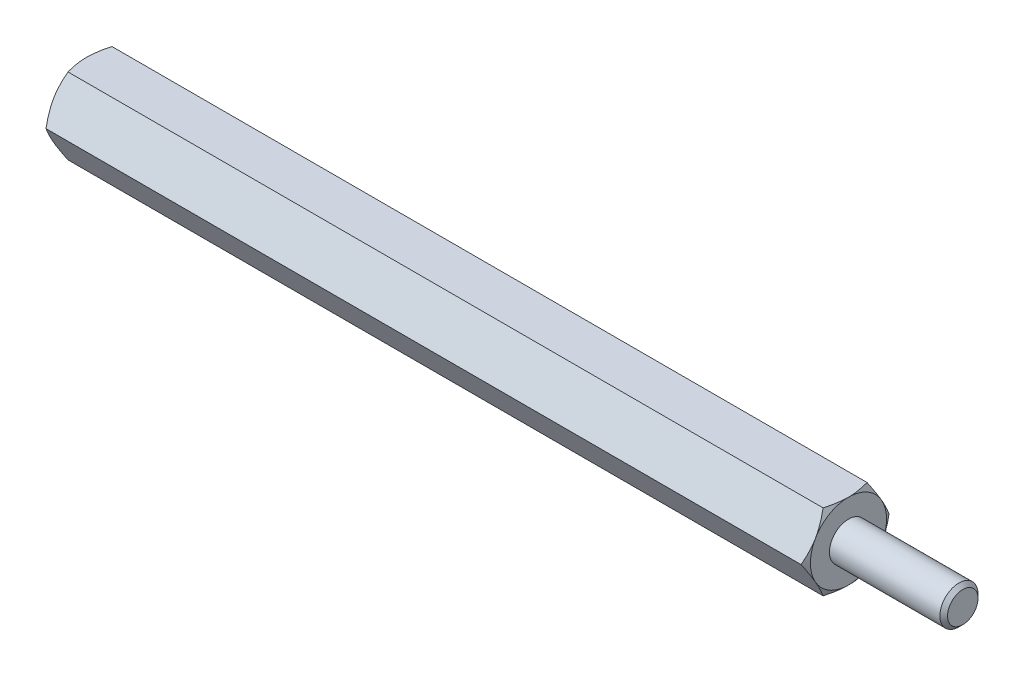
from build123d import *

# Parameters (mm, degrees)
EXTRUDE2_DEPTH = 20
SKETCH3_R      = 0.8
EXTRUDE3_DEPTH = 6
SKETCH5_R      = 1
EXTRUDE4_DEPTH = 6
CHAMFER1_SIZE  = 0.2


with BuildPart() as part:
    # Sketch1 → Extrude2 (new, symmetric)
    with BuildSketch(Plane(origin=(0, 0, 0), x_dir=(0, 0, -1), z_dir=(1, 0, 0))):
        Polygon((1.154700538, 2), (-1.154700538, 2), (-2.309401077, 0), (-1.154700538, -2), (1.154700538, -2), (2.309401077, 0), align=None)
    extrude(amount=EXTRUDE2_DEPTH, both=True)

    # Sketch2 → Cut-Revolve1 (revolve, cut)
    with BuildSketch(Plane.XY):
        with BuildLine():
            Line((-20, 2), (-18.5, 4.598076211))
            ThreePointArc((-18.5, 4.598076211), (-18.98810136, 5.776457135), (-20, 5))
            Line((-20, 5), (-20, 2))
        make_face()
    cut_revolve1 = revolve(axis=Axis((0, 0, 0), (1, 0, 0)), mode=Mode.SUBTRACT)

    # Mirror1: Cut-Revolve1 across plane
    add(cut_revolve1.mirror(Plane(origin=(0, 0, 0), x_dir=(0, 0, 1), z_dir=(1, 0, 0))), mode=Mode.SUBTRACT)

    # Sketch3 → Extrude3 (cut)
    with BuildSketch(Plane.ZY.offset(20)):
        Circle(SKETCH3_R)
    extrude(amount=-EXTRUDE3_DEPTH, mode=Mode.SUBTRACT)

    # Sketch4 → Cut-Revolve2 (revolve, cut)
    with BuildSketch(Plane.XY, mode=Mode.PRIVATE) as cut_revolve2_sk:
        Polygon((-14, 0), (-14, 0.8), (-13.538119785, 0), align=None)
    revolve(cut_revolve2_sk.sketch.rotate(Axis((-13.538119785, 0, 0), (-1, 0, 0)), 270), axis=Axis((-13.538119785, 0, 0), (-1, 0, 0)), mode=Mode.SUBTRACT)

    # Sketch5 → Extrude4 (add)
    with BuildSketch(Plane(origin=(20, 0, 0), x_dir=(0, 0, -1), z_dir=(1, 0, 0))):
        Circle(SKETCH5_R)
    extrude(amount=EXTRUDE4_DEPTH)

    # Chamfer1
    chamfer1_edges = [part.edges().sort_by_distance(p)[0] for p in [
        (26, 0, 1),
    ]]
    chamfer(chamfer1_edges, length=CHAMFER1_SIZE)


solid = part.part
